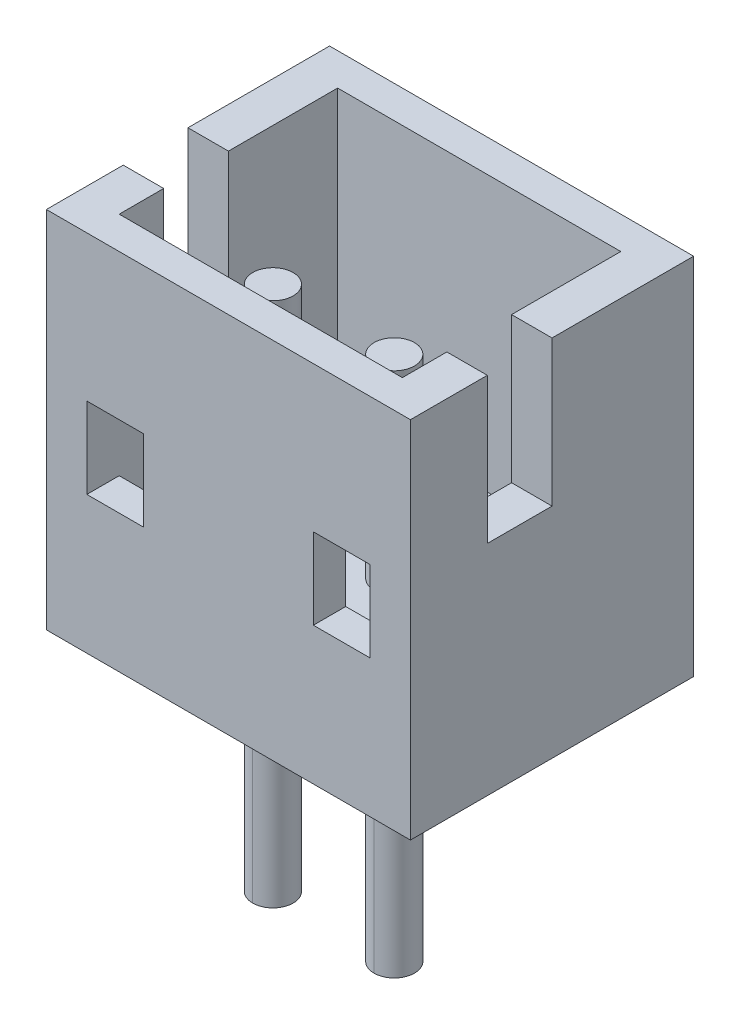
ISO-10303-21;
HEADER;
FILE_DESCRIPTION(('STEP AP214'),'2;1');
FILE_NAME('part.step','',(''),(''),'','','');
FILE_SCHEMA(('AUTOMOTIVE_DESIGN { 1 0 10303 214 1 1 1 1 }'));
ENDSEC;
DATA;
#1=APPLICATION_CONTEXT('core data for automotive mechanical design processes');
#2=APPLICATION_PROTOCOL_DEFINITION('international standard','automotive_design',2000,#1);
#3=PRODUCT_CONTEXT('',#1,'mechanical');
#4=PRODUCT('Part','Part','',(#3));
#5=PRODUCT_RELATED_PRODUCT_CATEGORY('part','',(#4));
#6=PRODUCT_DEFINITION_FORMATION('','',#4);
#7=PRODUCT_DEFINITION_CONTEXT('part definition',#1,'design');
#8=PRODUCT_DEFINITION('design','',#6,#7);
#9=PRODUCT_DEFINITION_SHAPE('','',#8);
#10=(LENGTH_UNIT() NAMED_UNIT(*) SI_UNIT(.MILLI.,.METRE.));
#11=(NAMED_UNIT(*) PLANE_ANGLE_UNIT() SI_UNIT($,.RADIAN.));
#12=(NAMED_UNIT(*) SI_UNIT($,.STERADIAN.) SOLID_ANGLE_UNIT());
#13=UNCERTAINTY_MEASURE_WITH_UNIT(LENGTH_MEASURE(1.E-05),#10,'distance_accuracy_value','');
#14=(GEOMETRIC_REPRESENTATION_CONTEXT(3) GLOBAL_UNCERTAINTY_ASSIGNED_CONTEXT((#13)) GLOBAL_UNIT_ASSIGNED_CONTEXT((#10,
#11,#12)) REPRESENTATION_CONTEXT('',''));
#15=CARTESIAN_POINT('',(0.,0.,0.));
#16=DIRECTION('',(0.,0.,1.));
#17=DIRECTION('',(1.,0.,0.));
#18=AXIS2_PLACEMENT_3D('',#15,#16,#17);
#19=CARTESIAN_POINT('',(0.75,3.8,-1.3));
#20=DIRECTION('',(0.,1.,0.));
#21=DIRECTION('',(1.,0.,0.));
#22=AXIS2_PLACEMENT_3D('',#19,#20,#21);
#23=PLANE('',#22);
#24=CARTESIAN_POINT('',(0.75,3.8,-1.3));
#25=DIRECTION('',(0.,1.,0.));
#26=DIRECTION('',(0.,0.,1.));
#27=AXIS2_PLACEMENT_3D('',#24,#25,#26);
#28=CIRCLE('',#27,0.25);
#29=CARTESIAN_POINT('',(0.75,3.8,-1.05));
#30=VERTEX_POINT('',#29);
#31=CARTESIAN_POINT('',(0.75,3.8,-1.55));
#32=VERTEX_POINT('',#31);
#33=EDGE_CURVE('E20',#30,#32,#28,.T.);
#34=ORIENTED_EDGE('',*,*,#33,.T.);
#35=CARTESIAN_POINT('',(0.75,3.8,-1.3));
#36=DIRECTION('',(0.,1.,0.));
#37=DIRECTION('',(0.,0.,1.));
#38=AXIS2_PLACEMENT_3D('',#35,#36,#37);
#39=CIRCLE('',#38,0.25);
#40=EDGE_CURVE('E26',#32,#30,#39,.T.);
#41=ORIENTED_EDGE('',*,*,#40,.T.);
#42=EDGE_LOOP('',(#34,#41));
#43=FACE_BOUND('',#42,.T.);
#44=ADVANCED_FACE('F17',(#43),#23,.T.);
#45=CARTESIAN_POINT('',(-0.75,3.8,-1.3));
#46=DIRECTION('',(0.,1.,0.));
#47=DIRECTION('',(1.,0.,0.));
#48=AXIS2_PLACEMENT_3D('',#45,#46,#47);
#49=PLANE('',#48);
#50=CARTESIAN_POINT('',(-0.75,3.8,-1.3));
#51=DIRECTION('',(0.,1.,0.));
#52=DIRECTION('',(0.,0.,1.));
#53=AXIS2_PLACEMENT_3D('',#50,#51,#52);
#54=CIRCLE('',#53,0.25);
#55=CARTESIAN_POINT('',(-0.75,3.8,-1.05));
#56=VERTEX_POINT('',#55);
#57=CARTESIAN_POINT('',(-0.75,3.8,-1.55));
#58=VERTEX_POINT('',#57);
#59=EDGE_CURVE('E10',#56,#58,#54,.T.);
#60=ORIENTED_EDGE('',*,*,#59,.T.);
#61=CARTESIAN_POINT('',(-0.75,3.8,-1.3));
#62=DIRECTION('',(0.,1.,0.));
#63=DIRECTION('',(0.,0.,1.));
#64=AXIS2_PLACEMENT_3D('',#61,#62,#63);
#65=CIRCLE('',#64,0.25);
#66=EDGE_CURVE('E551',#58,#56,#65,.T.);
#67=ORIENTED_EDGE('',*,*,#66,.T.);
#68=EDGE_LOOP('',(#60,#67));
#69=FACE_BOUND('',#68,.T.);
#70=ADVANCED_FACE('F806',(#69),#49,.T.);
#71=CARTESIAN_POINT('',(-0.75,-2.7,-1.3));
#72=DIRECTION('',(0.,1.,0.));
#73=DIRECTION('',(0.,0.,1.));
#74=AXIS2_PLACEMENT_3D('',#71,#72,#73);
#75=CYLINDRICAL_SURFACE('',#74,0.25);
#76=CARTESIAN_POINT('',(-0.75,1.4,-1.3));
#77=DIRECTION('',(0.,1.,0.));
#78=DIRECTION('',(0.,0.,1.));
#79=AXIS2_PLACEMENT_3D('',#76,#77,#78);
#80=CIRCLE('',#79,0.25);
#81=CARTESIAN_POINT('',(-0.75,1.4,-1.05));
#82=VERTEX_POINT('',#81);
#83=CARTESIAN_POINT('',(-0.75,1.4,-1.55));
#84=VERTEX_POINT('',#83);
#85=EDGE_CURVE('E386',#82,#84,#80,.T.);
#86=ORIENTED_EDGE('',*,*,#85,.T.);
#87=DIRECTION('',(0.,1.,0.));
#88=VECTOR('',#87,1.);
#89=CARTESIAN_POINT('',(-0.75,-2.7,-1.55));
#90=LINE('',#89,#88);
#91=EDGE_CURVE('E561',#84,#58,#90,.T.);
#92=ORIENTED_EDGE('',*,*,#91,.T.);
#93=ORIENTED_EDGE('',*,*,#59,.F.);
#94=DIRECTION('',(0.,1.,0.));
#95=VECTOR('',#94,1.);
#96=CARTESIAN_POINT('',(-0.75,-2.7,-1.05));
#97=LINE('',#96,#95);
#98=EDGE_CURVE('E565',#82,#56,#97,.T.);
#99=ORIENTED_EDGE('',*,*,#98,.F.);
#100=EDGE_LOOP('',(#86,#92,#93,#99));
#101=FACE_BOUND('',#100,.T.);
#102=ADVANCED_FACE('F810',(#101),#75,.T.);
#103=CARTESIAN_POINT('',(0.75,-2.7,-1.3));
#104=DIRECTION('',(0.,1.,0.));
#105=DIRECTION('',(0.,0.,1.));
#106=AXIS2_PLACEMENT_3D('',#103,#104,#105);
#107=CYLINDRICAL_SURFACE('',#106,0.25);
#108=DIRECTION('',(0.,1.,0.));
#109=VECTOR('',#108,1.);
#110=CARTESIAN_POINT('',(0.75,-2.7,-1.55));
#111=LINE('',#110,#109);
#112=CARTESIAN_POINT('',(0.75,1.4,-1.55));
#113=VERTEX_POINT('',#112);
#114=EDGE_CURVE('E547',#113,#32,#111,.T.);
#115=ORIENTED_EDGE('',*,*,#114,.F.);
#116=CARTESIAN_POINT('',(0.75,1.4,-1.3));
#117=DIRECTION('',(0.,1.,0.));
#118=DIRECTION('',(0.,0.,1.));
#119=AXIS2_PLACEMENT_3D('',#116,#117,#118);
#120=CIRCLE('',#119,0.25);
#121=CARTESIAN_POINT('',(0.75,1.4,-1.05));
#122=VERTEX_POINT('',#121);
#123=EDGE_CURVE('E421',#113,#122,#120,.T.);
#124=ORIENTED_EDGE('',*,*,#123,.T.);
#125=DIRECTION('',(0.,1.,0.));
#126=VECTOR('',#125,1.);
#127=CARTESIAN_POINT('',(0.75,-2.7,-1.05));
#128=LINE('',#127,#126);
#129=EDGE_CURVE('E632',#122,#30,#128,.T.);
#130=ORIENTED_EDGE('',*,*,#129,.T.);
#131=ORIENTED_EDGE('',*,*,#40,.F.);
#132=EDGE_LOOP('',(#115,#124,#130,#131));
#133=FACE_BOUND('',#132,.T.);
#134=ADVANCED_FACE('F663',(#133),#107,.T.);
#135=CARTESIAN_POINT('',(0.75,-2.7,-1.3));
#136=DIRECTION('',(0.,1.,0.));
#137=DIRECTION('',(0.,0.,1.));
#138=AXIS2_PLACEMENT_3D('',#135,#136,#137);
#139=CYLINDRICAL_SURFACE('',#138,0.25);
#140=CARTESIAN_POINT('',(0.75,1.4,-1.3));
#141=DIRECTION('',(0.,1.,0.));
#142=DIRECTION('',(0.,0.,1.));
#143=AXIS2_PLACEMENT_3D('',#140,#141,#142);
#144=CIRCLE('',#143,0.25);
#145=EDGE_CURVE('E417',#122,#113,#144,.T.);
#146=ORIENTED_EDGE('',*,*,#145,.T.);
#147=ORIENTED_EDGE('',*,*,#114,.T.);
#148=ORIENTED_EDGE('',*,*,#33,.F.);
#149=ORIENTED_EDGE('',*,*,#129,.F.);
#150=EDGE_LOOP('',(#146,#147,#148,#149));
#151=FACE_BOUND('',#150,.T.);
#152=ADVANCED_FACE('F660',(#151),#139,.T.);
#153=CARTESIAN_POINT('',(-0.75,-2.7,-1.3));
#154=DIRECTION('',(0.,1.,0.));
#155=DIRECTION('',(0.,0.,1.));
#156=AXIS2_PLACEMENT_3D('',#153,#154,#155);
#157=CYLINDRICAL_SURFACE('',#156,0.25);
#158=ORIENTED_EDGE('',*,*,#91,.F.);
#159=CARTESIAN_POINT('',(-0.75,1.4,-1.3));
#160=DIRECTION('',(0.,1.,0.));
#161=DIRECTION('',(0.,0.,1.));
#162=AXIS2_PLACEMENT_3D('',#159,#160,#161);
#163=CIRCLE('',#162,0.25);
#164=EDGE_CURVE('E389',#84,#82,#163,.T.);
#165=ORIENTED_EDGE('',*,*,#164,.T.);
#166=ORIENTED_EDGE('',*,*,#98,.T.);
#167=ORIENTED_EDGE('',*,*,#66,.F.);
#168=EDGE_LOOP('',(#158,#165,#166,#167));
#169=FACE_BOUND('',#168,.T.);
#170=ADVANCED_FACE('F857',(#169),#157,.T.);
#171=CARTESIAN_POINT('',(1.75,1.1,-2.05));
#172=DIRECTION('',(0.,0.707106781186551,-0.707106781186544));
#173=DIRECTION('',(-1.,0.,0.));
#174=AXIS2_PLACEMENT_3D('',#171,#172,#173);
#175=PLANE('',#174);
#176=DIRECTION('',(0.,-0.707106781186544,-0.707106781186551));
#177=VECTOR('',#176,1.);
#178=CARTESIAN_POINT('',(-1.75,1.1,-2.05));
#179=LINE('',#178,#177);
#180=CARTESIAN_POINT('',(-1.75,1.4,-1.75));
#181=VERTEX_POINT('',#180);
#182=CARTESIAN_POINT('',(-1.75,1.1,-2.05));
#183=VERTEX_POINT('',#182);
#184=EDGE_CURVE('E401',#181,#183,#179,.T.);
#185=ORIENTED_EDGE('',*,*,#184,.F.);
#186=DIRECTION('',(-1.,0.,0.));
#187=VECTOR('',#186,1.);
#188=CARTESIAN_POINT('',(1.75,1.4,-1.75));
#189=LINE('',#188,#187);
#190=CARTESIAN_POINT('',(1.75,1.4,-1.75));
#191=VERTEX_POINT('',#190);
#192=EDGE_CURVE('E390',#191,#181,#189,.T.);
#193=ORIENTED_EDGE('',*,*,#192,.F.);
#194=DIRECTION('',(0.,-0.707106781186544,-0.707106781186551));
#195=VECTOR('',#194,1.);
#196=CARTESIAN_POINT('',(1.75,1.1,-2.05));
#197=LINE('',#196,#195);
#198=CARTESIAN_POINT('',(1.75,1.1,-2.05));
#199=VERTEX_POINT('',#198);
#200=EDGE_CURVE('E615',#191,#199,#197,.T.);
#201=ORIENTED_EDGE('',*,*,#200,.T.);
#202=DIRECTION('',(-1.,0.,0.));
#203=VECTOR('',#202,1.);
#204=CARTESIAN_POINT('',(1.75,1.1,-2.05));
#205=LINE('',#204,#203);
#206=EDGE_CURVE('E566',#199,#183,#205,.T.);
#207=ORIENTED_EDGE('',*,*,#206,.T.);
#208=EDGE_LOOP('',(#185,#193,#201,#207));
#209=FACE_BOUND('',#208,.T.);
#210=ADVANCED_FACE('F686',(#209),#175,.T.);
#211=CARTESIAN_POINT('',(1.75,1.1,-3.1));
#212=DIRECTION('',(0.,1.,0.));
#213=DIRECTION('',(0.,0.,-1.));
#214=AXIS2_PLACEMENT_3D('',#211,#212,#213);
#215=PLANE('',#214);
#216=DIRECTION('',(0.,0.,-1.));
#217=VECTOR('',#216,1.);
#218=CARTESIAN_POINT('',(-1.75,1.1,-3.1));
#219=LINE('',#218,#217);
#220=CARTESIAN_POINT('',(-1.75,1.1,-3.1));
#221=VERTEX_POINT('',#220);
#222=EDGE_CURVE('E435',#183,#221,#219,.T.);
#223=ORIENTED_EDGE('',*,*,#222,.F.);
#224=ORIENTED_EDGE('',*,*,#206,.F.);
#225=DIRECTION('',(0.,0.,-1.));
#226=VECTOR('',#225,1.);
#227=CARTESIAN_POINT('',(1.75,1.1,-3.1));
#228=LINE('',#227,#226);
#229=CARTESIAN_POINT('',(1.75,1.1,-3.1));
#230=VERTEX_POINT('',#229);
#231=EDGE_CURVE('E611',#199,#230,#228,.T.);
#232=ORIENTED_EDGE('',*,*,#231,.T.);
#233=DIRECTION('',(-1.,0.,0.));
#234=VECTOR('',#233,1.);
#235=CARTESIAN_POINT('',(1.75,1.1,-3.1));
#236=LINE('',#235,#234);
#237=EDGE_CURVE('E458',#230,#221,#236,.T.);
#238=ORIENTED_EDGE('',*,*,#237,.T.);
#239=EDGE_LOOP('',(#223,#224,#232,#238));
#240=FACE_BOUND('',#239,.T.);
#241=ADVANCED_FACE('F669',(#240),#215,.T.);
#242=CARTESIAN_POINT('',(-1.75,1.4,-3.1));
#243=DIRECTION('',(0.,1.,0.));
#244=DIRECTION('',(1.,0.,0.));
#245=AXIS2_PLACEMENT_3D('',#242,#243,#244);
#246=PLANE('',#245);
#247=ORIENTED_EDGE('',*,*,#145,.F.);
#248=ORIENTED_EDGE('',*,*,#123,.F.);
#249=EDGE_LOOP('',(#247,#248));
#250=FACE_BOUND('',#249,.T.);
#251=ORIENTED_EDGE('',*,*,#85,.F.);
#252=ORIENTED_EDGE('',*,*,#164,.F.);
#253=EDGE_LOOP('',(#251,#252));
#254=FACE_BOUND('',#253,.T.);
#255=DIRECTION('',(0.,0.,-1.));
#256=VECTOR('',#255,1.);
#257=CARTESIAN_POINT('',(1.75,1.4,-3.1));
#258=LINE('',#257,#256);
#259=CARTESIAN_POINT('',(1.75,1.4,-0.4));
#260=VERTEX_POINT('',#259);
#261=EDGE_CURVE('E619',#260,#191,#258,.T.);
#262=ORIENTED_EDGE('',*,*,#261,.T.);
#263=ORIENTED_EDGE('',*,*,#192,.T.);
#264=DIRECTION('',(0.,0.,1.));
#265=VECTOR('',#264,1.);
#266=CARTESIAN_POINT('',(-1.75,1.4,-3.1));
#267=LINE('',#266,#265);
#268=CARTESIAN_POINT('',(-1.75,1.4,-0.4));
#269=VERTEX_POINT('',#268);
#270=EDGE_CURVE('E379',#181,#269,#267,.T.);
#271=ORIENTED_EDGE('',*,*,#270,.T.);
#272=DIRECTION('',(1.,0.,0.));
#273=VECTOR('',#272,1.);
#274=CARTESIAN_POINT('',(-1.75,1.4,-0.4));
#275=LINE('',#274,#273);
#276=EDGE_CURVE('E461',#269,#260,#275,.T.);
#277=ORIENTED_EDGE('',*,*,#276,.T.);
#278=EDGE_LOOP('',(#262,#263,#271,#277));
#279=FACE_BOUND('',#278,.T.);
#280=ADVANCED_FACE('F665',(#250,#254,#279),#246,.T.);
#281=CARTESIAN_POINT('',(-1.75,1.4,-3.1));
#282=DIRECTION('',(0.,0.,-1.));
#283=DIRECTION('',(-1.,0.,0.));
#284=AXIS2_PLACEMENT_3D('',#281,#282,#283);
#285=PLANE('',#284);
#286=DIRECTION('',(-1.,0.,0.));
#287=VECTOR('',#286,1.);
#288=CARTESIAN_POINT('',(-1.75,4.5,-3.1));
#289=LINE('',#288,#287);
#290=CARTESIAN_POINT('',(1.75,4.5,-3.1));
#291=VERTEX_POINT('',#290);
#292=CARTESIAN_POINT('',(-1.75,4.5,-3.1));
#293=VERTEX_POINT('',#292);
#294=EDGE_CURVE('E560',#291,#293,#289,.T.);
#295=ORIENTED_EDGE('',*,*,#294,.T.);
#296=DIRECTION('',(0.,1.,0.));
#297=VECTOR('',#296,1.);
#298=CARTESIAN_POINT('',(-1.75,1.4,-3.1));
#299=LINE('',#298,#297);
#300=EDGE_CURVE('E439',#221,#293,#299,.T.);
#301=ORIENTED_EDGE('',*,*,#300,.F.);
#302=ORIENTED_EDGE('',*,*,#237,.F.);
#303=DIRECTION('',(0.,1.,0.));
#304=VECTOR('',#303,1.);
#305=CARTESIAN_POINT('',(1.75,1.4,-3.1));
#306=LINE('',#305,#304);
#307=EDGE_CURVE('E608',#230,#291,#306,.T.);
#308=ORIENTED_EDGE('',*,*,#307,.T.);
#309=EDGE_LOOP('',(#295,#301,#302,#308));
#310=FACE_BOUND('',#309,.T.);
#311=ADVANCED_FACE('F668',(#310),#285,.F.);
#312=CARTESIAN_POINT('',(-1.75,1.4,-0.4));
#313=DIRECTION('',(0.,0.,1.));
#314=DIRECTION('',(1.,0.,0.));
#315=AXIS2_PLACEMENT_3D('',#312,#313,#314);
#316=PLANE('',#315);
#317=DIRECTION('',(0.,1.,0.));
#318=VECTOR('',#317,1.);
#319=CARTESIAN_POINT('',(1.75,1.4,-0.4));
#320=LINE('',#319,#318);
#321=CARTESIAN_POINT('',(1.75,2.7,-0.4));
#322=VERTEX_POINT('',#321);
#323=CARTESIAN_POINT('',(1.75,4.5,-0.4));
#324=VERTEX_POINT('',#323);
#325=EDGE_CURVE('E360',#322,#324,#320,.T.);
#326=ORIENTED_EDGE('',*,*,#325,.F.);
#327=DIRECTION('',(1.,0.,0.));
#328=VECTOR('',#327,1.);
#329=CARTESIAN_POINT('',(1.75,2.7,-0.4));
#330=LINE('',#329,#328);
#331=CARTESIAN_POINT('',(1.05,2.7,-0.4));
#332=VERTEX_POINT('',#331);
#333=EDGE_CURVE('E465',#332,#322,#330,.T.);
#334=ORIENTED_EDGE('',*,*,#333,.F.);
#335=DIRECTION('',(0.,1.,0.));
#336=VECTOR('',#335,1.);
#337=CARTESIAN_POINT('',(1.05,2.7,-0.4));
#338=LINE('',#337,#336);
#339=CARTESIAN_POINT('',(1.05,1.7,-0.4));
#340=VERTEX_POINT('',#339);
#341=EDGE_CURVE('E532',#340,#332,#338,.T.);
#342=ORIENTED_EDGE('',*,*,#341,.F.);
#343=DIRECTION('',(-1.,0.,0.));
#344=VECTOR('',#343,1.);
#345=CARTESIAN_POINT('',(1.75,1.7,-0.4));
#346=LINE('',#345,#344);
#347=CARTESIAN_POINT('',(1.75,1.7,-0.4));
#348=VERTEX_POINT('',#347);
#349=EDGE_CURVE('E633',#348,#340,#346,.T.);
#350=ORIENTED_EDGE('',*,*,#349,.F.);
#351=DIRECTION('',(0.,1.,0.));
#352=VECTOR('',#351,1.);
#353=CARTESIAN_POINT('',(1.75,1.4,-0.4));
#354=LINE('',#353,#352);
#355=EDGE_CURVE('E375',#260,#348,#354,.T.);
#356=ORIENTED_EDGE('',*,*,#355,.F.);
#357=ORIENTED_EDGE('',*,*,#276,.F.);
#358=DIRECTION('',(0.,1.,0.));
#359=VECTOR('',#358,1.);
#360=CARTESIAN_POINT('',(-1.75,1.4,-0.4));
#361=LINE('',#360,#359);
#362=CARTESIAN_POINT('',(-1.75,1.7,-0.4));
#363=VERTEX_POINT('',#362);
#364=EDGE_CURVE('E376',#269,#363,#361,.T.);
#365=ORIENTED_EDGE('',*,*,#364,.T.);
#366=DIRECTION('',(-1.,0.,0.));
#367=VECTOR('',#366,1.);
#368=CARTESIAN_POINT('',(-1.75,1.7,-0.4));
#369=LINE('',#368,#367);
#370=CARTESIAN_POINT('',(-1.05,1.7,-0.4));
#371=VERTEX_POINT('',#370);
#372=EDGE_CURVE('E636',#371,#363,#369,.T.);
#373=ORIENTED_EDGE('',*,*,#372,.F.);
#374=DIRECTION('',(0.,-1.,0.));
#375=VECTOR('',#374,1.);
#376=CARTESIAN_POINT('',(-1.05,2.7,-0.4));
#377=LINE('',#376,#375);
#378=CARTESIAN_POINT('',(-1.05,2.7,-0.4));
#379=VERTEX_POINT('',#378);
#380=EDGE_CURVE('E542',#379,#371,#377,.T.);
#381=ORIENTED_EDGE('',*,*,#380,.F.);
#382=DIRECTION('',(1.,0.,0.));
#383=VECTOR('',#382,1.);
#384=CARTESIAN_POINT('',(-1.75,2.7,-0.4));
#385=LINE('',#384,#383);
#386=CARTESIAN_POINT('',(-1.75,2.7,-0.4));
#387=VERTEX_POINT('',#386);
#388=EDGE_CURVE('E363',#387,#379,#385,.T.);
#389=ORIENTED_EDGE('',*,*,#388,.F.);
#390=DIRECTION('',(0.,1.,0.));
#391=VECTOR('',#390,1.);
#392=CARTESIAN_POINT('',(-1.75,1.4,-0.4));
#393=LINE('',#392,#391);
#394=CARTESIAN_POINT('',(-1.75,4.5,-0.4));
#395=VERTEX_POINT('',#394);
#396=EDGE_CURVE('E552',#387,#395,#393,.T.);
#397=ORIENTED_EDGE('',*,*,#396,.T.);
#398=DIRECTION('',(1.,0.,0.));
#399=VECTOR('',#398,1.);
#400=CARTESIAN_POINT('',(-1.75,4.5,-0.4));
#401=LINE('',#400,#399);
#402=EDGE_CURVE('E522',#395,#324,#401,.T.);
#403=ORIENTED_EDGE('',*,*,#402,.T.);
#404=EDGE_LOOP('',(#326,#334,#342,#350,#356,#357,#365,#373,#381,#389,#397,#403));
#405=FACE_BOUND('',#404,.T.);
#406=ADVANCED_FACE('F695',(#405),#316,.F.);
#407=CARTESIAN_POINT('',(-1.05,2.7,-3.501));
#408=DIRECTION('',(1.,0.,0.));
#409=DIRECTION('',(0.,1.,0.));
#410=AXIS2_PLACEMENT_3D('',#407,#408,#409);
#411=PLANE('',#410);
#412=ORIENTED_EDGE('',*,*,#380,.T.);
#413=DIRECTION('',(0.,0.,1.));
#414=VECTOR('',#413,1.);
#415=CARTESIAN_POINT('',(-1.05,1.7,-3.501));
#416=LINE('',#415,#414);
#417=CARTESIAN_POINT('',(-1.05,1.7,0.));
#418=VERTEX_POINT('',#417);
#419=EDGE_CURVE('E639',#371,#418,#416,.T.);
#420=ORIENTED_EDGE('',*,*,#419,.T.);
#421=DIRECTION('',(0.,1.,0.));
#422=VECTOR('',#421,1.);
#423=CARTESIAN_POINT('',(-1.05,2.7,0.));
#424=LINE('',#423,#422);
#425=CARTESIAN_POINT('',(-1.05,2.7,0.));
#426=VERTEX_POINT('',#425);
#427=EDGE_CURVE('E487',#418,#426,#424,.T.);
#428=ORIENTED_EDGE('',*,*,#427,.T.);
#429=DIRECTION('',(0.,0.,1.));
#430=VECTOR('',#429,1.);
#431=CARTESIAN_POINT('',(-1.05,2.7,-3.501));
#432=LINE('',#431,#430);
#433=EDGE_CURVE('E629',#379,#426,#432,.T.);
#434=ORIENTED_EDGE('',*,*,#433,.F.);
#435=EDGE_LOOP('',(#412,#420,#428,#434));
#436=FACE_BOUND('',#435,.T.);
#437=ADVANCED_FACE('F838',(#436),#411,.F.);
#438=CARTESIAN_POINT('',(-1.75,1.7,-3.501));
#439=DIRECTION('',(0.,-1.,0.));
#440=DIRECTION('',(0.,0.,-1.));
#441=AXIS2_PLACEMENT_3D('',#438,#439,#440);
#442=PLANE('',#441);
#443=ORIENTED_EDGE('',*,*,#372,.T.);
#444=DIRECTION('',(0.,0.,1.));
#445=VECTOR('',#444,1.);
#446=CARTESIAN_POINT('',(-1.75,1.7,-3.501));
#447=LINE('',#446,#445);
#448=CARTESIAN_POINT('',(-1.75,1.7,0.));
#449=VERTEX_POINT('',#448);
#450=EDGE_CURVE('E380',#363,#449,#447,.T.);
#451=ORIENTED_EDGE('',*,*,#450,.T.);
#452=DIRECTION('',(1.,0.,0.));
#453=VECTOR('',#452,1.);
#454=CARTESIAN_POINT('',(-1.75,1.7,0.));
#455=LINE('',#454,#453);
#456=EDGE_CURVE('E491',#449,#418,#455,.T.);
#457=ORIENTED_EDGE('',*,*,#456,.T.);
#458=ORIENTED_EDGE('',*,*,#419,.F.);
#459=EDGE_LOOP('',(#443,#451,#457,#458));
#460=FACE_BOUND('',#459,.T.);
#461=ADVANCED_FACE('F829',(#460),#442,.F.);
#462=CARTESIAN_POINT('',(1.75,1.7,-3.501));
#463=DIRECTION('',(0.,-1.,0.));
#464=DIRECTION('',(0.,0.,-1.));
#465=AXIS2_PLACEMENT_3D('',#462,#463,#464);
#466=PLANE('',#465);
#467=ORIENTED_EDGE('',*,*,#349,.T.);
#468=DIRECTION('',(0.,0.,1.));
#469=VECTOR('',#468,1.);
#470=CARTESIAN_POINT('',(1.05,1.7,-3.501));
#471=LINE('',#470,#469);
#472=CARTESIAN_POINT('',(1.05,1.7,0.));
#473=VERTEX_POINT('',#472);
#474=EDGE_CURVE('E462',#340,#473,#471,.T.);
#475=ORIENTED_EDGE('',*,*,#474,.T.);
#476=DIRECTION('',(1.,0.,0.));
#477=VECTOR('',#476,1.);
#478=CARTESIAN_POINT('',(1.75,1.7,0.));
#479=LINE('',#478,#477);
#480=CARTESIAN_POINT('',(1.75,1.7,0.));
#481=VERTEX_POINT('',#480);
#482=EDGE_CURVE('E483',#473,#481,#479,.T.);
#483=ORIENTED_EDGE('',*,*,#482,.T.);
#484=DIRECTION('',(0.,0.,1.));
#485=VECTOR('',#484,1.);
#486=CARTESIAN_POINT('',(1.75,1.7,-3.501));
#487=LINE('',#486,#485);
#488=EDGE_CURVE('E364',#348,#481,#487,.T.);
#489=ORIENTED_EDGE('',*,*,#488,.F.);
#490=EDGE_LOOP('',(#467,#475,#483,#489));
#491=FACE_BOUND('',#490,.T.);
#492=ADVANCED_FACE('F703',(#491),#466,.F.);
#493=CARTESIAN_POINT('',(-1.75,2.7,-3.501));
#494=DIRECTION('',(0.,1.,0.));
#495=DIRECTION('',(1.,0.,0.));
#496=AXIS2_PLACEMENT_3D('',#493,#494,#495);
#497=PLANE('',#496);
#498=ORIENTED_EDGE('',*,*,#388,.T.);
#499=ORIENTED_EDGE('',*,*,#433,.T.);
#500=DIRECTION('',(-1.,0.,0.));
#501=VECTOR('',#500,1.);
#502=CARTESIAN_POINT('',(-1.75,2.7,0.));
#503=LINE('',#502,#501);
#504=CARTESIAN_POINT('',(-1.75,2.7,0.));
#505=VERTEX_POINT('',#504);
#506=EDGE_CURVE('E499',#426,#505,#503,.T.);
#507=ORIENTED_EDGE('',*,*,#506,.T.);
#508=DIRECTION('',(0.,0.,1.));
#509=VECTOR('',#508,1.);
#510=CARTESIAN_POINT('',(-1.75,2.7,-3.501));
#511=LINE('',#510,#509);
#512=EDGE_CURVE('E555',#387,#505,#511,.T.);
#513=ORIENTED_EDGE('',*,*,#512,.F.);
#514=EDGE_LOOP('',(#498,#499,#507,#513));
#515=FACE_BOUND('',#514,.T.);
#516=ADVANCED_FACE('F828',(#515),#497,.F.);
#517=CARTESIAN_POINT('',(1.75,1.4,-3.1));
#518=DIRECTION('',(1.,0.,0.));
#519=DIRECTION('',(0.,1.,0.));
#520=AXIS2_PLACEMENT_3D('',#517,#518,#519);
#521=PLANE('',#520);
#522=DIRECTION('',(0.,0.,-1.));
#523=VECTOR('',#522,1.);
#524=CARTESIAN_POINT('',(1.75,4.5,-3.1));
#525=LINE('',#524,#523);
#526=CARTESIAN_POINT('',(1.75,4.5,-0.95));
#527=VERTEX_POINT('',#526);
#528=EDGE_CURVE('E519',#324,#527,#525,.T.);
#529=ORIENTED_EDGE('',*,*,#528,.T.);
#530=DIRECTION('',(0.,-1.,0.));
#531=VECTOR('',#530,1.);
#532=CARTESIAN_POINT('',(1.75,1.4,-0.95));
#533=LINE('',#532,#531);
#534=CARTESIAN_POINT('',(1.75,2.7,-0.95));
#535=VERTEX_POINT('',#534);
#536=EDGE_CURVE('E515',#527,#535,#533,.T.);
#537=ORIENTED_EDGE('',*,*,#536,.T.);
#538=DIRECTION('',(0.,0.,-1.));
#539=VECTOR('',#538,1.);
#540=CARTESIAN_POINT('',(1.75,2.7,-3.1));
#541=LINE('',#540,#539);
#542=CARTESIAN_POINT('',(1.75,2.7,-1.75));
#543=VERTEX_POINT('',#542);
#544=EDGE_CURVE('E531',#535,#543,#541,.T.);
#545=ORIENTED_EDGE('',*,*,#544,.T.);
#546=DIRECTION('',(0.,1.,0.));
#547=VECTOR('',#546,1.);
#548=CARTESIAN_POINT('',(1.75,1.4,-1.75));
#549=LINE('',#548,#547);
#550=CARTESIAN_POINT('',(1.75,4.5,-1.75));
#551=VERTEX_POINT('',#550);
#552=EDGE_CURVE('E352',#543,#551,#549,.T.);
#553=ORIENTED_EDGE('',*,*,#552,.T.);
#554=DIRECTION('',(0.,0.,-1.));
#555=VECTOR('',#554,1.);
#556=CARTESIAN_POINT('',(1.75,4.5,-3.1));
#557=LINE('',#556,#555);
#558=EDGE_CURVE('E572',#551,#291,#557,.T.);
#559=ORIENTED_EDGE('',*,*,#558,.T.);
#560=ORIENTED_EDGE('',*,*,#307,.F.);
#561=ORIENTED_EDGE('',*,*,#231,.F.);
#562=ORIENTED_EDGE('',*,*,#200,.F.);
#563=ORIENTED_EDGE('',*,*,#261,.F.);
#564=ORIENTED_EDGE('',*,*,#355,.T.);
#565=ORIENTED_EDGE('',*,*,#488,.T.);
#566=DIRECTION('',(0.,1.,0.));
#567=VECTOR('',#566,1.);
#568=CARTESIAN_POINT('',(1.75,2.7,0.));
#569=LINE('',#568,#567);
#570=CARTESIAN_POINT('',(1.75,2.7,0.));
#571=VERTEX_POINT('',#570);
#572=EDGE_CURVE('E479',#481,#571,#569,.T.);
#573=ORIENTED_EDGE('',*,*,#572,.T.);
#574=DIRECTION('',(0.,0.,1.));
#575=VECTOR('',#574,1.);
#576=CARTESIAN_POINT('',(1.75,2.7,-3.501));
#577=LINE('',#576,#575);
#578=EDGE_CURVE('E556',#322,#571,#577,.T.);
#579=ORIENTED_EDGE('',*,*,#578,.F.);
#580=ORIENTED_EDGE('',*,*,#325,.T.);
#581=EDGE_LOOP('',(#529,#537,#545,#553,#559,#560,#561,#562,#563,#564,#565,#573,#579,#580));
#582=FACE_BOUND('',#581,.T.);
#583=ADVANCED_FACE('F683',(#582),#521,.F.);
#584=CARTESIAN_POINT('',(-1.75,1.4,-3.1));
#585=DIRECTION('',(-1.,0.,0.));
#586=DIRECTION('',(0.,0.,1.));
#587=AXIS2_PLACEMENT_3D('',#584,#585,#586);
#588=PLANE('',#587);
#589=DIRECTION('',(0.,0.,1.));
#590=VECTOR('',#589,1.);
#591=CARTESIAN_POINT('',(-1.75,2.7,-3.1));
#592=LINE('',#591,#590);
#593=CARTESIAN_POINT('',(-1.75,2.7,-1.75));
#594=VERTEX_POINT('',#593);
#595=CARTESIAN_POINT('',(-1.75,2.7,-0.95));
#596=VERTEX_POINT('',#595);
#597=EDGE_CURVE('E588',#594,#596,#592,.T.);
#598=ORIENTED_EDGE('',*,*,#597,.T.);
#599=DIRECTION('',(0.,1.,0.));
#600=VECTOR('',#599,1.);
#601=CARTESIAN_POINT('',(-1.75,1.4,-0.95));
#602=LINE('',#601,#600);
#603=CARTESIAN_POINT('',(-1.75,4.5,-0.95));
#604=VERTEX_POINT('',#603);
#605=EDGE_CURVE('E536',#596,#604,#602,.T.);
#606=ORIENTED_EDGE('',*,*,#605,.T.);
#607=DIRECTION('',(0.,0.,1.));
#608=VECTOR('',#607,1.);
#609=CARTESIAN_POINT('',(-1.75,4.5,-3.1));
#610=LINE('',#609,#608);
#611=EDGE_CURVE('E526',#604,#395,#610,.T.);
#612=ORIENTED_EDGE('',*,*,#611,.T.);
#613=ORIENTED_EDGE('',*,*,#396,.F.);
#614=ORIENTED_EDGE('',*,*,#512,.T.);
#615=DIRECTION('',(0.,-1.,0.));
#616=VECTOR('',#615,1.);
#617=CARTESIAN_POINT('',(-1.75,2.7,0.));
#618=LINE('',#617,#616);
#619=EDGE_CURVE('E495',#505,#449,#618,.T.);
#620=ORIENTED_EDGE('',*,*,#619,.T.);
#621=ORIENTED_EDGE('',*,*,#450,.F.);
#622=ORIENTED_EDGE('',*,*,#364,.F.);
#623=ORIENTED_EDGE('',*,*,#270,.F.);
#624=ORIENTED_EDGE('',*,*,#184,.T.);
#625=ORIENTED_EDGE('',*,*,#222,.T.);
#626=ORIENTED_EDGE('',*,*,#300,.T.);
#627=DIRECTION('',(0.,0.,1.));
#628=VECTOR('',#627,1.);
#629=CARTESIAN_POINT('',(-1.75,4.5,-3.1));
#630=LINE('',#629,#628);
#631=CARTESIAN_POINT('',(-1.75,4.5,-1.75));
#632=VERTEX_POINT('',#631);
#633=EDGE_CURVE('E546',#293,#632,#630,.T.);
#634=ORIENTED_EDGE('',*,*,#633,.T.);
#635=DIRECTION('',(0.,-1.,0.));
#636=VECTOR('',#635,1.);
#637=CARTESIAN_POINT('',(-1.75,1.4,-1.75));
#638=LINE('',#637,#636);
#639=EDGE_CURVE('E580',#632,#594,#638,.T.);
#640=ORIENTED_EDGE('',*,*,#639,.T.);
#641=EDGE_LOOP('',(#598,#606,#612,#613,#614,#620,#621,#622,#623,#624,#625,#626,#634,#640));
#642=FACE_BOUND('',#641,.T.);
#643=ADVANCED_FACE('F691',(#642),#588,.F.);
#644=CARTESIAN_POINT('',(1.75,2.7,-3.501));
#645=DIRECTION('',(0.,1.,0.));
#646=DIRECTION('',(1.,0.,0.));
#647=AXIS2_PLACEMENT_3D('',#644,#645,#646);
#648=PLANE('',#647);
#649=ORIENTED_EDGE('',*,*,#333,.T.);
#650=ORIENTED_EDGE('',*,*,#578,.T.);
#651=DIRECTION('',(-1.,0.,0.));
#652=VECTOR('',#651,1.);
#653=CARTESIAN_POINT('',(1.75,2.7,0.));
#654=LINE('',#653,#652);
#655=CARTESIAN_POINT('',(1.05,2.7,0.));
#656=VERTEX_POINT('',#655);
#657=EDGE_CURVE('E475',#571,#656,#654,.T.);
#658=ORIENTED_EDGE('',*,*,#657,.T.);
#659=DIRECTION('',(0.,0.,1.));
#660=VECTOR('',#659,1.);
#661=CARTESIAN_POINT('',(1.05,2.7,-3.501));
#662=LINE('',#661,#660);
#663=EDGE_CURVE('E466',#332,#656,#662,.T.);
#664=ORIENTED_EDGE('',*,*,#663,.F.);
#665=EDGE_LOOP('',(#649,#650,#658,#664));
#666=FACE_BOUND('',#665,.T.);
#667=ADVANCED_FACE('F711',(#666),#648,.F.);
#668=CARTESIAN_POINT('',(1.05,2.7,-3.501));
#669=DIRECTION('',(-1.,0.,0.));
#670=DIRECTION('',(0.,0.,1.));
#671=AXIS2_PLACEMENT_3D('',#668,#669,#670);
#672=PLANE('',#671);
#673=ORIENTED_EDGE('',*,*,#341,.T.);
#674=ORIENTED_EDGE('',*,*,#663,.T.);
#675=DIRECTION('',(0.,-1.,0.));
#676=VECTOR('',#675,1.);
#677=CARTESIAN_POINT('',(1.05,2.7,0.));
#678=LINE('',#677,#676);
#679=EDGE_CURVE('E471',#656,#473,#678,.T.);
#680=ORIENTED_EDGE('',*,*,#679,.T.);
#681=ORIENTED_EDGE('',*,*,#474,.F.);
#682=EDGE_LOOP('',(#673,#674,#680,#681));
#683=FACE_BOUND('',#682,.T.);
#684=ADVANCED_FACE('F832',(#683),#672,.F.);
#685=CARTESIAN_POINT('',(-2.25,4.5,-0.95));
#686=DIRECTION('',(0.,0.,1.));
#687=DIRECTION('',(0.,-1.,0.));
#688=AXIS2_PLACEMENT_3D('',#685,#686,#687);
#689=PLANE('',#688);
#690=DIRECTION('',(1.,0.,0.));
#691=VECTOR('',#690,1.);
#692=CARTESIAN_POINT('',(-2.25,2.7,-0.95));
#693=LINE('',#692,#691);
#694=CARTESIAN_POINT('',(-2.25,2.7,-0.95));
#695=VERTEX_POINT('',#694);
#696=EDGE_CURVE('E584',#695,#596,#693,.T.);
#697=ORIENTED_EDGE('',*,*,#696,.F.);
#698=DIRECTION('',(0.,-1.,0.));
#699=VECTOR('',#698,1.);
#700=CARTESIAN_POINT('',(-2.25,4.5,-0.95));
#701=LINE('',#700,#699);
#702=CARTESIAN_POINT('',(-2.25,4.5,-0.95));
#703=VERTEX_POINT('',#702);
#704=EDGE_CURVE('E448',#703,#695,#701,.T.);
#705=ORIENTED_EDGE('',*,*,#704,.F.);
#706=DIRECTION('',(1.,0.,0.));
#707=VECTOR('',#706,1.);
#708=CARTESIAN_POINT('',(-2.25,4.5,-0.95));
#709=LINE('',#708,#707);
#710=EDGE_CURVE('E527',#703,#604,#709,.T.);
#711=ORIENTED_EDGE('',*,*,#710,.T.);
#712=ORIENTED_EDGE('',*,*,#605,.F.);
#713=EDGE_LOOP('',(#697,#705,#711,#712));
#714=FACE_BOUND('',#713,.T.);
#715=ADVANCED_FACE('F752',(#714),#689,.F.);
#716=CARTESIAN_POINT('',(-2.25,2.7,-0.95));
#717=DIRECTION('',(0.,-1.,0.));
#718=DIRECTION('',(0.,0.,-1.));
#719=AXIS2_PLACEMENT_3D('',#716,#717,#718);
#720=PLANE('',#719);
#721=DIRECTION('',(1.,0.,0.));
#722=VECTOR('',#721,1.);
#723=CARTESIAN_POINT('',(-2.25,2.7,-1.75));
#724=LINE('',#723,#722);
#725=CARTESIAN_POINT('',(-2.25,2.7,-1.75));
#726=VERTEX_POINT('',#725);
#727=EDGE_CURVE('E576',#726,#594,#724,.T.);
#728=ORIENTED_EDGE('',*,*,#727,.F.);
#729=DIRECTION('',(0.,0.,-1.));
#730=VECTOR('',#729,1.);
#731=CARTESIAN_POINT('',(-2.25,2.7,-0.95));
#732=LINE('',#731,#730);
#733=EDGE_CURVE('E406',#695,#726,#732,.T.);
#734=ORIENTED_EDGE('',*,*,#733,.F.);
#735=ORIENTED_EDGE('',*,*,#696,.T.);
#736=ORIENTED_EDGE('',*,*,#597,.F.);
#737=EDGE_LOOP('',(#728,#734,#735,#736));
#738=FACE_BOUND('',#737,.T.);
#739=ADVANCED_FACE('F748',(#738),#720,.F.);
#740=CARTESIAN_POINT('',(-2.25,4.5,-1.75));
#741=DIRECTION('',(0.,0.,-1.));
#742=DIRECTION('',(-1.,0.,0.));
#743=AXIS2_PLACEMENT_3D('',#740,#741,#742);
#744=PLANE('',#743);
#745=DIRECTION('',(1.,0.,0.));
#746=VECTOR('',#745,1.);
#747=CARTESIAN_POINT('',(-2.25,4.5,-1.75));
#748=LINE('',#747,#746);
#749=CARTESIAN_POINT('',(-2.25,4.5,-1.75));
#750=VERTEX_POINT('',#749);
#751=EDGE_CURVE('E539',#750,#632,#748,.T.);
#752=ORIENTED_EDGE('',*,*,#751,.F.);
#753=DIRECTION('',(0.,1.,0.));
#754=VECTOR('',#753,1.);
#755=CARTESIAN_POINT('',(-2.25,4.5,-1.75));
#756=LINE('',#755,#754);
#757=EDGE_CURVE('E402',#726,#750,#756,.T.);
#758=ORIENTED_EDGE('',*,*,#757,.F.);
#759=ORIENTED_EDGE('',*,*,#727,.T.);
#760=ORIENTED_EDGE('',*,*,#639,.F.);
#761=EDGE_LOOP('',(#752,#758,#759,#760));
#762=FACE_BOUND('',#761,.T.);
#763=ADVANCED_FACE('F745',(#762),#744,.F.);
#764=CARTESIAN_POINT('',(0.75,-2.7,-1.3));
#765=DIRECTION('',(0.,1.,0.));
#766=DIRECTION('',(1.,0.,0.));
#767=AXIS2_PLACEMENT_3D('',#764,#765,#766);
#768=PLANE('',#767);
#769=CARTESIAN_POINT('',(0.75,-2.7,-1.3));
#770=DIRECTION('',(0.,1.,0.));
#771=DIRECTION('',(0.,0.,1.));
#772=AXIS2_PLACEMENT_3D('',#769,#770,#771);
#773=CIRCLE('',#772,0.25);
#774=CARTESIAN_POINT('',(0.75,-2.7,-1.05));
#775=VERTEX_POINT('',#774);
#776=CARTESIAN_POINT('',(0.75,-2.7,-1.55));
#777=VERTEX_POINT('',#776);
#778=EDGE_CURVE('E424',#775,#777,#773,.T.);
#779=ORIENTED_EDGE('',*,*,#778,.F.);
#780=CARTESIAN_POINT('',(0.75,-2.7,-1.3));
#781=DIRECTION('',(0.,1.,0.));
#782=DIRECTION('',(0.,0.,1.));
#783=AXIS2_PLACEMENT_3D('',#780,#781,#782);
#784=CIRCLE('',#783,0.25);
#785=EDGE_CURVE('E434',#777,#775,#784,.T.);
#786=ORIENTED_EDGE('',*,*,#785,.F.);
#787=EDGE_LOOP('',(#779,#786));
#788=FACE_BOUND('',#787,.T.);
#789=ADVANCED_FACE('F823',(#788),#768,.F.);
#790=CARTESIAN_POINT('',(2.25,4.5,0.));
#791=DIRECTION('',(0.,-1.,0.));
#792=DIRECTION('',(0.,0.,-1.));
#793=AXIS2_PLACEMENT_3D('',#790,#791,#792);
#794=PLANE('',#793);
#795=DIRECTION('',(0.,0.,1.));
#796=VECTOR('',#795,1.);
#797=CARTESIAN_POINT('',(-2.25,4.5,0.));
#798=LINE('',#797,#796);
#799=CARTESIAN_POINT('',(-2.25,4.5,-3.5));
#800=VERTEX_POINT('',#799);
#801=EDGE_CURVE('E405',#800,#750,#798,.T.);
#802=ORIENTED_EDGE('',*,*,#801,.T.);
#803=ORIENTED_EDGE('',*,*,#751,.T.);
#804=ORIENTED_EDGE('',*,*,#633,.F.);
#805=ORIENTED_EDGE('',*,*,#294,.F.);
#806=ORIENTED_EDGE('',*,*,#558,.F.);
#807=DIRECTION('',(1.,0.,0.));
#808=VECTOR('',#807,1.);
#809=CARTESIAN_POINT('',(-2.25,4.5,-1.75));
#810=LINE('',#809,#808);
#811=CARTESIAN_POINT('',(2.25,4.5,-1.75));
#812=VERTEX_POINT('',#811);
#813=EDGE_CURVE('E506',#551,#812,#810,.T.);
#814=ORIENTED_EDGE('',*,*,#813,.T.);
#815=DIRECTION('',(0.,0.,1.));
#816=VECTOR('',#815,1.);
#817=CARTESIAN_POINT('',(2.25,4.5,0.));
#818=LINE('',#817,#816);
#819=CARTESIAN_POINT('',(2.25,4.5,-3.5));
#820=VERTEX_POINT('',#819);
#821=EDGE_CURVE('E325',#820,#812,#818,.T.);
#822=ORIENTED_EDGE('',*,*,#821,.F.);
#823=DIRECTION('',(-1.,0.,0.));
#824=VECTOR('',#823,1.);
#825=CARTESIAN_POINT('',(2.25,4.5,-3.5));
#826=LINE('',#825,#824);
#827=EDGE_CURVE('E320',#820,#800,#826,.T.);
#828=ORIENTED_EDGE('',*,*,#827,.T.);
#829=EDGE_LOOP('',(#802,#803,#804,#805,#806,#814,#822,#828));
#830=FACE_BOUND('',#829,.T.);
#831=ADVANCED_FACE('F737',(#830),#794,.F.);
#832=CARTESIAN_POINT('',(-2.25,2.7,-0.95));
#833=DIRECTION('',(0.,-1.,0.));
#834=DIRECTION('',(0.,0.,-1.));
#835=AXIS2_PLACEMENT_3D('',#832,#833,#834);
#836=PLANE('',#835);
#837=DIRECTION('',(1.,0.,0.));
#838=VECTOR('',#837,1.);
#839=CARTESIAN_POINT('',(-2.25,2.7,-0.95));
#840=LINE('',#839,#838);
#841=CARTESIAN_POINT('',(2.25,2.7,-0.95));
#842=VERTEX_POINT('',#841);
#843=EDGE_CURVE('E512',#535,#842,#840,.T.);
#844=ORIENTED_EDGE('',*,*,#843,.T.);
#845=DIRECTION('',(0.,0.,-1.));
#846=VECTOR('',#845,1.);
#847=CARTESIAN_POINT('',(2.25,2.7,-0.95));
#848=LINE('',#847,#846);
#849=CARTESIAN_POINT('',(2.25,2.7,-1.75));
#850=VERTEX_POINT('',#849);
#851=EDGE_CURVE('E367',#842,#850,#848,.T.);
#852=ORIENTED_EDGE('',*,*,#851,.T.);
#853=DIRECTION('',(1.,0.,0.));
#854=VECTOR('',#853,1.);
#855=CARTESIAN_POINT('',(-2.25,2.7,-1.75));
#856=LINE('',#855,#854);
#857=EDGE_CURVE('E503',#543,#850,#856,.T.);
#858=ORIENTED_EDGE('',*,*,#857,.F.);
#859=ORIENTED_EDGE('',*,*,#544,.F.);
#860=EDGE_LOOP('',(#844,#852,#858,#859));
#861=FACE_BOUND('',#860,.T.);
#862=ADVANCED_FACE('F735',(#861),#836,.F.);
#863=CARTESIAN_POINT('',(2.25,4.5,0.));
#864=DIRECTION('',(0.,-1.,0.));
#865=DIRECTION('',(0.,0.,-1.));
#866=AXIS2_PLACEMENT_3D('',#863,#864,#865);
#867=PLANE('',#866);
#868=DIRECTION('',(0.,0.,1.));
#869=VECTOR('',#868,1.);
#870=CARTESIAN_POINT('',(2.25,4.5,0.));
#871=LINE('',#870,#869);
#872=CARTESIAN_POINT('',(2.25,4.5,-0.95));
#873=VERTEX_POINT('',#872);
#874=CARTESIAN_POINT('',(2.25,4.5,0.));
#875=VERTEX_POINT('',#874);
#876=EDGE_CURVE('E392',#873,#875,#871,.T.);
#877=ORIENTED_EDGE('',*,*,#876,.F.);
#878=DIRECTION('',(1.,0.,0.));
#879=VECTOR('',#878,1.);
#880=CARTESIAN_POINT('',(-2.25,4.5,-0.95));
#881=LINE('',#880,#879);
#882=EDGE_CURVE('E509',#527,#873,#881,.T.);
#883=ORIENTED_EDGE('',*,*,#882,.F.);
#884=ORIENTED_EDGE('',*,*,#528,.F.);
#885=ORIENTED_EDGE('',*,*,#402,.F.);
#886=ORIENTED_EDGE('',*,*,#611,.F.);
#887=ORIENTED_EDGE('',*,*,#710,.F.);
#888=DIRECTION('',(0.,0.,1.));
#889=VECTOR('',#888,1.);
#890=CARTESIAN_POINT('',(-2.25,4.5,0.));
#891=LINE('',#890,#889);
#892=CARTESIAN_POINT('',(-2.25,4.5,0.));
#893=VERTEX_POINT('',#892);
#894=EDGE_CURVE('E440',#703,#893,#891,.T.);
#895=ORIENTED_EDGE('',*,*,#894,.T.);
#896=DIRECTION('',(-1.,0.,0.));
#897=VECTOR('',#896,1.);
#898=CARTESIAN_POINT('',(2.25,4.5,0.));
#899=LINE('',#898,#897);
#900=EDGE_CURVE('E444',#875,#893,#899,.T.);
#901=ORIENTED_EDGE('',*,*,#900,.F.);
#902=EDGE_LOOP('',(#877,#883,#884,#885,#886,#887,#895,#901));
#903=FACE_BOUND('',#902,.T.);
#904=ADVANCED_FACE('F721',(#903),#867,.F.);
#905=CARTESIAN_POINT('',(-2.25,4.5,-0.95));
#906=DIRECTION('',(0.,0.,1.));
#907=DIRECTION('',(0.,-1.,0.));
#908=AXIS2_PLACEMENT_3D('',#905,#906,#907);
#909=PLANE('',#908);
#910=ORIENTED_EDGE('',*,*,#882,.T.);
#911=DIRECTION('',(0.,-1.,0.));
#912=VECTOR('',#911,1.);
#913=CARTESIAN_POINT('',(2.25,4.5,-0.95));
#914=LINE('',#913,#912);
#915=EDGE_CURVE('E371',#873,#842,#914,.T.);
#916=ORIENTED_EDGE('',*,*,#915,.T.);
#917=ORIENTED_EDGE('',*,*,#843,.F.);
#918=ORIENTED_EDGE('',*,*,#536,.F.);
#919=EDGE_LOOP('',(#910,#916,#917,#918));
#920=FACE_BOUND('',#919,.T.);
#921=ADVANCED_FACE('F724',(#920),#909,.F.);
#922=CARTESIAN_POINT('',(-2.25,4.5,-1.75));
#923=DIRECTION('',(0.,0.,-1.));
#924=DIRECTION('',(-1.,0.,0.));
#925=AXIS2_PLACEMENT_3D('',#922,#923,#924);
#926=PLANE('',#925);
#927=ORIENTED_EDGE('',*,*,#857,.T.);
#928=DIRECTION('',(0.,1.,0.));
#929=VECTOR('',#928,1.);
#930=CARTESIAN_POINT('',(2.25,4.5,-1.75));
#931=LINE('',#930,#929);
#932=EDGE_CURVE('E410',#850,#812,#931,.T.);
#933=ORIENTED_EDGE('',*,*,#932,.T.);
#934=ORIENTED_EDGE('',*,*,#813,.F.);
#935=ORIENTED_EDGE('',*,*,#552,.F.);
#936=EDGE_LOOP('',(#927,#933,#934,#935));
#937=FACE_BOUND('',#936,.T.);
#938=ADVANCED_FACE('F732',(#937),#926,.F.);
#939=CARTESIAN_POINT('',(2.25,0.,0.));
#940=DIRECTION('',(0.,0.,-1.));
#941=DIRECTION('',(0.,-1.,0.));
#942=AXIS2_PLACEMENT_3D('',#939,#940,#941);
#943=PLANE('',#942);
#944=ORIENTED_EDGE('',*,*,#427,.F.);
#945=ORIENTED_EDGE('',*,*,#456,.F.);
#946=ORIENTED_EDGE('',*,*,#619,.F.);
#947=ORIENTED_EDGE('',*,*,#506,.F.);
#948=EDGE_LOOP('',(#944,#945,#946,#947));
#949=FACE_BOUND('',#948,.T.);
#950=ORIENTED_EDGE('',*,*,#679,.F.);
#951=ORIENTED_EDGE('',*,*,#657,.F.);
#952=ORIENTED_EDGE('',*,*,#572,.F.);
#953=ORIENTED_EDGE('',*,*,#482,.F.);
#954=EDGE_LOOP('',(#950,#951,#952,#953));
#955=FACE_BOUND('',#954,.T.);
#956=DIRECTION('',(0.,-1.,0.));
#957=VECTOR('',#956,1.);
#958=CARTESIAN_POINT('',(-2.25,0.,0.));
#959=LINE('',#958,#957);
#960=CARTESIAN_POINT('',(-2.25,0.,0.));
#961=VERTEX_POINT('',#960);
#962=EDGE_CURVE('E445',#893,#961,#959,.T.);
#963=ORIENTED_EDGE('',*,*,#962,.T.);
#964=DIRECTION('',(-1.,0.,0.));
#965=VECTOR('',#964,1.);
#966=CARTESIAN_POINT('',(2.25,0.,0.));
#967=LINE('',#966,#965);
#968=CARTESIAN_POINT('',(2.25,0.,0.));
#969=VERTEX_POINT('',#968);
#970=EDGE_CURVE('E338',#969,#961,#967,.T.);
#971=ORIENTED_EDGE('',*,*,#970,.F.);
#972=DIRECTION('',(0.,-1.,0.));
#973=VECTOR('',#972,1.);
#974=CARTESIAN_POINT('',(2.25,0.,0.));
#975=LINE('',#974,#973);
#976=EDGE_CURVE('E326',#875,#969,#975,.T.);
#977=ORIENTED_EDGE('',*,*,#976,.F.);
#978=ORIENTED_EDGE('',*,*,#900,.T.);
#979=EDGE_LOOP('',(#963,#971,#977,#978));
#980=FACE_BOUND('',#979,.T.);
#981=ADVANCED_FACE('F707',(#949,#955,#980),#943,.F.);
#982=CARTESIAN_POINT('',(-2.25,4.5,0.));
#983=DIRECTION('',(-1.,0.,0.));
#984=DIRECTION('',(0.,0.,1.));
#985=AXIS2_PLACEMENT_3D('',#982,#983,#984);
#986=PLANE('',#985);
#987=ORIENTED_EDGE('',*,*,#704,.T.);
#988=ORIENTED_EDGE('',*,*,#733,.T.);
#989=ORIENTED_EDGE('',*,*,#757,.T.);
#990=ORIENTED_EDGE('',*,*,#801,.F.);
#991=DIRECTION('',(0.,1.,0.));
#992=VECTOR('',#991,1.);
#993=CARTESIAN_POINT('',(-2.25,0.,-3.5));
#994=LINE('',#993,#992);
#995=CARTESIAN_POINT('',(-2.25,0.,-3.5));
#996=VERTEX_POINT('',#995);
#997=EDGE_CURVE('E414',#996,#800,#994,.T.);
#998=ORIENTED_EDGE('',*,*,#997,.F.);
#999=DIRECTION('',(0.,0.,-1.));
#1000=VECTOR('',#999,1.);
#1001=CARTESIAN_POINT('',(-2.25,0.,0.));
#1002=LINE('',#1001,#1000);
#1003=EDGE_CURVE('E342',#961,#996,#1002,.T.);
#1004=ORIENTED_EDGE('',*,*,#1003,.F.);
#1005=ORIENTED_EDGE('',*,*,#962,.F.);
#1006=ORIENTED_EDGE('',*,*,#894,.F.);
#1007=EDGE_LOOP('',(#987,#988,#989,#990,#998,#1004,#1005,#1006));
#1008=FACE_BOUND('',#1007,.T.);
#1009=ADVANCED_FACE('F791',(#1008),#986,.T.);
#1010=CARTESIAN_POINT('',(0.75,-2.7,-1.3));
#1011=DIRECTION('',(0.,1.,0.));
#1012=DIRECTION('',(0.,0.,1.));
#1013=AXIS2_PLACEMENT_3D('',#1010,#1011,#1012);
#1014=CYLINDRICAL_SURFACE('',#1013,0.25);
#1015=DIRECTION('',(0.,1.,0.));
#1016=VECTOR('',#1015,1.);
#1017=CARTESIAN_POINT('',(0.75,-2.7,-1.55));
#1018=LINE('',#1017,#1016);
#1019=CARTESIAN_POINT('',(0.75,0.,-1.55));
#1020=VERTEX_POINT('',#1019);
#1021=EDGE_CURVE('E428',#777,#1020,#1018,.T.);
#1022=ORIENTED_EDGE('',*,*,#1021,.F.);
#1023=ORIENTED_EDGE('',*,*,#785,.T.);
#1024=DIRECTION('',(0.,1.,0.));
#1025=VECTOR('',#1024,1.);
#1026=CARTESIAN_POINT('',(0.75,-2.7,-1.05));
#1027=LINE('',#1026,#1025);
#1028=CARTESIAN_POINT('',(0.75,0.,-1.05));
#1029=VERTEX_POINT('',#1028);
#1030=EDGE_CURVE('E431',#775,#1029,#1027,.T.);
#1031=ORIENTED_EDGE('',*,*,#1030,.T.);
#1032=CARTESIAN_POINT('',(0.75,0.,-1.3));
#1033=DIRECTION('',(0.,1.,0.));
#1034=DIRECTION('',(0.,0.,1.));
#1035=AXIS2_PLACEMENT_3D('',#1032,#1033,#1034);
#1036=CIRCLE('',#1035,0.25);
#1037=EDGE_CURVE('E372',#1020,#1029,#1036,.T.);
#1038=ORIENTED_EDGE('',*,*,#1037,.F.);
#1039=EDGE_LOOP('',(#1022,#1023,#1031,#1038));
#1040=FACE_BOUND('',#1039,.T.);
#1041=ADVANCED_FACE('F800',(#1040),#1014,.T.);
#1042=CARTESIAN_POINT('',(0.75,-2.7,-1.3));
#1043=DIRECTION('',(0.,1.,0.));
#1044=DIRECTION('',(0.,0.,1.));
#1045=AXIS2_PLACEMENT_3D('',#1042,#1043,#1044);
#1046=CYLINDRICAL_SURFACE('',#1045,0.25);
#1047=ORIENTED_EDGE('',*,*,#778,.T.);
#1048=ORIENTED_EDGE('',*,*,#1021,.T.);
#1049=CARTESIAN_POINT('',(0.75,0.,-1.3));
#1050=DIRECTION('',(0.,1.,0.));
#1051=DIRECTION('',(0.,0.,1.));
#1052=AXIS2_PLACEMENT_3D('',#1049,#1050,#1051);
#1053=CIRCLE('',#1052,0.25);
#1054=EDGE_CURVE('E382',#1029,#1020,#1053,.T.);
#1055=ORIENTED_EDGE('',*,*,#1054,.F.);
#1056=ORIENTED_EDGE('',*,*,#1030,.F.);
#1057=EDGE_LOOP('',(#1047,#1048,#1055,#1056));
#1058=FACE_BOUND('',#1057,.T.);
#1059=ADVANCED_FACE('F1025',(#1058),#1046,.T.);
#1060=CARTESIAN_POINT('',(2.25,0.,-3.5));
#1061=DIRECTION('',(0.,0.,1.));
#1062=DIRECTION('',(0.,-1.,0.));
#1063=AXIS2_PLACEMENT_3D('',#1060,#1061,#1062);
#1064=PLANE('',#1063);
#1065=ORIENTED_EDGE('',*,*,#997,.T.);
#1066=ORIENTED_EDGE('',*,*,#827,.F.);
#1067=DIRECTION('',(0.,1.,0.));
#1068=VECTOR('',#1067,1.);
#1069=CARTESIAN_POINT('',(2.25,0.,-3.5));
#1070=LINE('',#1069,#1068);
#1071=CARTESIAN_POINT('',(2.25,0.,-3.5));
#1072=VERTEX_POINT('',#1071);
#1073=EDGE_CURVE('E312',#1072,#820,#1070,.T.);
#1074=ORIENTED_EDGE('',*,*,#1073,.F.);
#1075=DIRECTION('',(-1.,0.,0.));
#1076=VECTOR('',#1075,1.);
#1077=CARTESIAN_POINT('',(2.25,0.,-3.5));
#1078=LINE('',#1077,#1076);
#1079=EDGE_CURVE('E317',#1072,#996,#1078,.T.);
#1080=ORIENTED_EDGE('',*,*,#1079,.T.);
#1081=EDGE_LOOP('',(#1065,#1066,#1074,#1080));
#1082=FACE_BOUND('',#1081,.T.);
#1083=ADVANCED_FACE('F315',(#1082),#1064,.F.);
#1084=CARTESIAN_POINT('',(2.25,4.5,0.));
#1085=DIRECTION('',(-1.,0.,0.));
#1086=DIRECTION('',(0.,0.,1.));
#1087=AXIS2_PLACEMENT_3D('',#1084,#1085,#1086);
#1088=PLANE('',#1087);
#1089=ORIENTED_EDGE('',*,*,#851,.F.);
#1090=ORIENTED_EDGE('',*,*,#915,.F.);
#1091=ORIENTED_EDGE('',*,*,#876,.T.);
#1092=ORIENTED_EDGE('',*,*,#976,.T.);
#1093=DIRECTION('',(0.,0.,-1.));
#1094=VECTOR('',#1093,1.);
#1095=CARTESIAN_POINT('',(2.25,0.,0.));
#1096=LINE('',#1095,#1094);
#1097=EDGE_CURVE('E329',#969,#1072,#1096,.T.);
#1098=ORIENTED_EDGE('',*,*,#1097,.T.);
#1099=ORIENTED_EDGE('',*,*,#1073,.T.);
#1100=ORIENTED_EDGE('',*,*,#821,.T.);
#1101=ORIENTED_EDGE('',*,*,#932,.F.);
#1102=EDGE_LOOP('',(#1089,#1090,#1091,#1092,#1098,#1099,#1100,#1101));
#1103=FACE_BOUND('',#1102,.T.);
#1104=ADVANCED_FACE('F331',(#1103),#1088,.F.);
#1105=CARTESIAN_POINT('',(2.25,0.,0.));
#1106=DIRECTION('',(0.,1.,0.));
#1107=DIRECTION('',(1.,0.,0.));
#1108=AXIS2_PLACEMENT_3D('',#1105,#1106,#1107);
#1109=PLANE('',#1108);
#1110=CARTESIAN_POINT('',(-0.75,0.,-1.3));
#1111=DIRECTION('',(0.,1.,0.));
#1112=DIRECTION('',(0.,0.,1.));
#1113=AXIS2_PLACEMENT_3D('',#1110,#1111,#1112);
#1114=CIRCLE('',#1113,0.25);
#1115=CARTESIAN_POINT('',(-0.75,0.,-1.05));
#1116=VERTEX_POINT('',#1115);
#1117=CARTESIAN_POINT('',(-0.75,0.,-1.55));
#1118=VERTEX_POINT('',#1117);
#1119=EDGE_CURVE('E348',#1116,#1118,#1114,.T.);
#1120=ORIENTED_EDGE('',*,*,#1119,.T.);
#1121=CARTESIAN_POINT('',(-0.75,0.,-1.3));
#1122=DIRECTION('',(0.,1.,0.));
#1123=DIRECTION('',(0.,0.,1.));
#1124=AXIS2_PLACEMENT_3D('',#1121,#1122,#1123);
#1125=CIRCLE('',#1124,0.25);
#1126=EDGE_CURVE('E354',#1118,#1116,#1125,.T.);
#1127=ORIENTED_EDGE('',*,*,#1126,.T.);
#1128=EDGE_LOOP('',(#1120,#1127));
#1129=FACE_BOUND('',#1128,.T.);
#1130=ORIENTED_EDGE('',*,*,#1054,.T.);
#1131=ORIENTED_EDGE('',*,*,#1037,.T.);
#1132=EDGE_LOOP('',(#1130,#1131));
#1133=FACE_BOUND('',#1132,.T.);
#1134=ORIENTED_EDGE('',*,*,#1003,.T.);
#1135=ORIENTED_EDGE('',*,*,#1079,.F.);
#1136=ORIENTED_EDGE('',*,*,#1097,.F.);
#1137=ORIENTED_EDGE('',*,*,#970,.T.);
#1138=EDGE_LOOP('',(#1134,#1135,#1136,#1137));
#1139=FACE_BOUND('',#1138,.T.);
#1140=ADVANCED_FACE('F340',(#1129,#1133,#1139),#1109,.F.);
#1141=CARTESIAN_POINT('',(-0.75,-2.7,-1.3));
#1142=DIRECTION('',(0.,1.,0.));
#1143=DIRECTION('',(1.,0.,0.));
#1144=AXIS2_PLACEMENT_3D('',#1141,#1142,#1143);
#1145=PLANE('',#1144);
#1146=CARTESIAN_POINT('',(-0.75,-2.7,-1.3));
#1147=DIRECTION('',(0.,1.,0.));
#1148=DIRECTION('',(0.,0.,1.));
#1149=AXIS2_PLACEMENT_3D('',#1146,#1147,#1148);
#1150=CIRCLE('',#1149,0.25);
#1151=CARTESIAN_POINT('',(-0.75,-2.7,-1.05));
#1152=VERTEX_POINT('',#1151);
#1153=CARTESIAN_POINT('',(-0.75,-2.7,-1.55));
#1154=VERTEX_POINT('',#1153);
#1155=EDGE_CURVE('E358',#1152,#1154,#1150,.T.);
#1156=ORIENTED_EDGE('',*,*,#1155,.F.);
#1157=CARTESIAN_POINT('',(-0.75,-2.7,-1.3));
#1158=DIRECTION('',(0.,1.,0.));
#1159=DIRECTION('',(0.,0.,1.));
#1160=AXIS2_PLACEMENT_3D('',#1157,#1158,#1159);
#1161=CIRCLE('',#1160,0.25);
#1162=EDGE_CURVE('E759',#1154,#1152,#1161,.T.);
#1163=ORIENTED_EDGE('',*,*,#1162,.F.);
#1164=EDGE_LOOP('',(#1156,#1163));
#1165=FACE_BOUND('',#1164,.T.);
#1166=ADVANCED_FACE('F1068',(#1165),#1145,.F.);
#1167=CARTESIAN_POINT('',(-0.75,-2.7,-1.3));
#1168=DIRECTION('',(0.,1.,0.));
#1169=DIRECTION('',(0.,0.,1.));
#1170=AXIS2_PLACEMENT_3D('',#1167,#1168,#1169);
#1171=CYLINDRICAL_SURFACE('',#1170,0.25);
#1172=ORIENTED_EDGE('',*,*,#1155,.T.);
#1173=DIRECTION('',(0.,1.,0.));
#1174=VECTOR('',#1173,1.);
#1175=CARTESIAN_POINT('',(-0.75,-2.7,-1.55));
#1176=LINE('',#1175,#1174);
#1177=EDGE_CURVE('E771',#1154,#1118,#1176,.T.);
#1178=ORIENTED_EDGE('',*,*,#1177,.T.);
#1179=ORIENTED_EDGE('',*,*,#1119,.F.);
#1180=DIRECTION('',(0.,1.,0.));
#1181=VECTOR('',#1180,1.);
#1182=CARTESIAN_POINT('',(-0.75,-2.7,-1.05));
#1183=LINE('',#1182,#1181);
#1184=EDGE_CURVE('E359',#1152,#1116,#1183,.T.);
#1185=ORIENTED_EDGE('',*,*,#1184,.F.);
#1186=EDGE_LOOP('',(#1172,#1178,#1179,#1185));
#1187=FACE_BOUND('',#1186,.T.);
#1188=ADVANCED_FACE('F1078',(#1187),#1171,.T.);
#1189=CARTESIAN_POINT('',(-0.75,-2.7,-1.3));
#1190=DIRECTION('',(0.,1.,0.));
#1191=DIRECTION('',(0.,0.,1.));
#1192=AXIS2_PLACEMENT_3D('',#1189,#1190,#1191);
#1193=CYLINDRICAL_SURFACE('',#1192,0.25);
#1194=ORIENTED_EDGE('',*,*,#1177,.F.);
#1195=ORIENTED_EDGE('',*,*,#1162,.T.);
#1196=ORIENTED_EDGE('',*,*,#1184,.T.);
#1197=ORIENTED_EDGE('',*,*,#1126,.F.);
#1198=EDGE_LOOP('',(#1194,#1195,#1196,#1197));
#1199=FACE_BOUND('',#1198,.T.);
#1200=ADVANCED_FACE('F1089',(#1199),#1193,.T.);
#1201=CLOSED_SHELL('',(#44,#70,#102,#134,#152,#170,#210,#241,#280,#311,#406,#437,#461,#492,#516,
#583,#643,#667,#684,#715,#739,#763,#789,#831,#862,#904,#921,#938,#981,#1009,#1041,#1059,#1083,
#1104,#1140,#1166,#1188,#1200));
#1202=MANIFOLD_SOLID_BREP('B1',#1201);
#1203=ADVANCED_BREP_SHAPE_REPRESENTATION('',(#18,#1202),#14);
#1204=SHAPE_DEFINITION_REPRESENTATION(#9,#1203);
ENDSEC;
END-ISO-10303-21;
